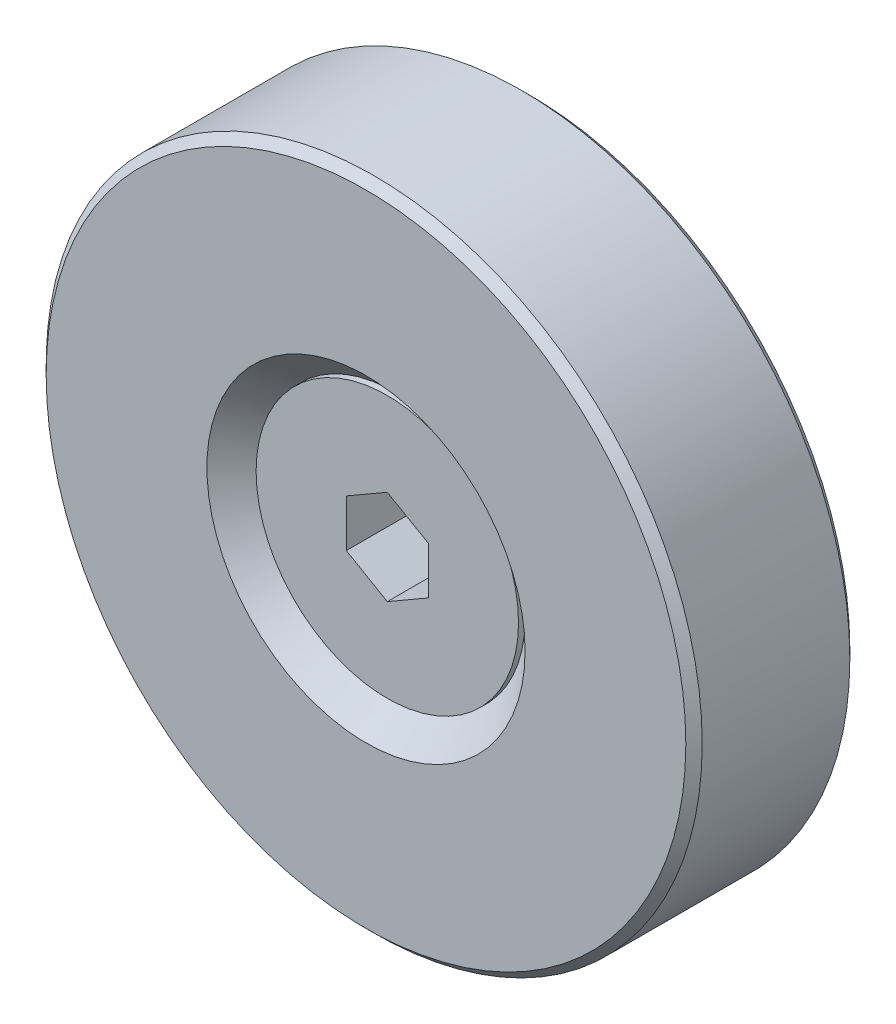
ISO-10303-21;
HEADER;
FILE_DESCRIPTION(('STEP AP214'),'2;1');
FILE_NAME('part.step','',(''),(''),'','','');
FILE_SCHEMA(('AUTOMOTIVE_DESIGN { 1 0 10303 214 1 1 1 1 }'));
ENDSEC;
DATA;
#1=APPLICATION_CONTEXT('core data for automotive mechanical design processes');
#2=APPLICATION_PROTOCOL_DEFINITION('international standard','automotive_design',2000,#1);
#3=PRODUCT_CONTEXT('',#1,'mechanical');
#4=PRODUCT('Part','Part','',(#3));
#5=PRODUCT_RELATED_PRODUCT_CATEGORY('part','',(#4));
#6=PRODUCT_DEFINITION_FORMATION('','',#4);
#7=PRODUCT_DEFINITION_CONTEXT('part definition',#1,'design');
#8=PRODUCT_DEFINITION('design','',#6,#7);
#9=PRODUCT_DEFINITION_SHAPE('','',#8);
#10=(LENGTH_UNIT() NAMED_UNIT(*) SI_UNIT(.MILLI.,.METRE.));
#11=(NAMED_UNIT(*) PLANE_ANGLE_UNIT() SI_UNIT($,.RADIAN.));
#12=(NAMED_UNIT(*) SI_UNIT($,.STERADIAN.) SOLID_ANGLE_UNIT());
#13=UNCERTAINTY_MEASURE_WITH_UNIT(LENGTH_MEASURE(1.E-05),#10,'distance_accuracy_value','');
#14=(GEOMETRIC_REPRESENTATION_CONTEXT(3) GLOBAL_UNCERTAINTY_ASSIGNED_CONTEXT((#13)) GLOBAL_UNIT_ASSIGNED_CONTEXT((#10,
#11,#12)) REPRESENTATION_CONTEXT('',''));
#15=CARTESIAN_POINT('',(0.,0.,0.));
#16=DIRECTION('',(0.,0.,1.));
#17=DIRECTION('',(1.,0.,0.));
#18=AXIS2_PLACEMENT_3D('',#15,#16,#17);
#19=CARTESIAN_POINT('',(0.,4.70000000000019,0.));
#20=DIRECTION('',(0.,0.,1.));
#21=DIRECTION('',(1.,0.,0.));
#22=AXIS2_PLACEMENT_3D('',#19,#20,#21);
#23=PLANE('',#22);
#24=CARTESIAN_POINT('',(0.,-1.87317522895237E-13,0.));
#25=DIRECTION('',(0.,0.,1.));
#26=DIRECTION('',(1.,0.,0.));
#27=AXIS2_PLACEMENT_3D('',#24,#25,#26);
#28=CIRCLE('',#27,4.70000000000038);
#29=CARTESIAN_POINT('',(4.70000000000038,-1.87317522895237E-13,0.));
#30=VERTEX_POINT('',#29);
#31=EDGE_CURVE('E140',#30,#30,#28,.T.);
#32=ORIENTED_EDGE('',*,*,#31,.T.);
#33=EDGE_LOOP('',(#32));
#34=FACE_BOUND('',#33,.T.);
#35=CARTESIAN_POINT('',(0.,0.,0.));
#36=DIRECTION('',(0.,0.,1.));
#37=DIRECTION('',(1.,0.,0.));
#38=AXIS2_PLACEMENT_3D('',#35,#36,#37);
#39=CIRCLE('',#38,19.5);
#40=CARTESIAN_POINT('',(19.5,0.,0.));
#41=VERTEX_POINT('',#40);
#42=EDGE_CURVE('E384',#41,#41,#39,.T.);
#43=ORIENTED_EDGE('',*,*,#42,.F.);
#44=EDGE_LOOP('',(#43));
#45=FACE_BOUND('',#44,.T.);
#46=ADVANCED_FACE('F14',(#34,#45),#23,.F.);
#47=CARTESIAN_POINT('',(0.,-1.87317522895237E-13,0.5));
#48=DIRECTION('',(0.,0.,-1.));
#49=DIRECTION('',(-1.,0.,0.));
#50=AXIS2_PLACEMENT_3D('',#47,#48,#49);
#51=CONICAL_SURFACE('',#50,4.20000000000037,0.785398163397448);
#52=ORIENTED_EDGE('',*,*,#31,.F.);
#53=EDGE_LOOP('',(#52));
#54=FACE_BOUND('',#53,.T.);
#55=CARTESIAN_POINT('',(0.,-1.87317522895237E-13,0.5));
#56=DIRECTION('',(0.,0.,1.));
#57=DIRECTION('',(1.,0.,0.));
#58=AXIS2_PLACEMENT_3D('',#55,#56,#57);
#59=CIRCLE('',#58,4.20000000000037);
#60=CARTESIAN_POINT('',(4.20000000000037,-1.87317522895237E-13,0.5));
#61=VERTEX_POINT('',#60);
#62=EDGE_CURVE('E137',#61,#61,#59,.T.);
#63=ORIENTED_EDGE('',*,*,#62,.T.);
#64=EDGE_LOOP('',(#63));
#65=FACE_BOUND('',#64,.T.);
#66=ADVANCED_FACE('F184',(#54,#65),#51,.F.);
#67=CARTESIAN_POINT('',(0.,-1.87317522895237E-13,15.0000000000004));
#68=DIRECTION('',(0.,0.,1.));
#69=DIRECTION('',(1.,0.,0.));
#70=AXIS2_PLACEMENT_3D('',#67,#68,#69);
#71=CYLINDRICAL_SURFACE('',#70,4.20000000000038);
#72=ORIENTED_EDGE('',*,*,#62,.F.);
#73=EDGE_LOOP('',(#72));
#74=FACE_BOUND('',#73,.T.);
#75=CARTESIAN_POINT('',(0.,-1.87317522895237E-13,4.5));
#76=DIRECTION('',(0.,0.,1.));
#77=DIRECTION('',(1.,0.,0.));
#78=AXIS2_PLACEMENT_3D('',#75,#76,#77);
#79=CIRCLE('',#78,4.20000000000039);
#80=CARTESIAN_POINT('',(4.20000000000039,-1.87317522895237E-13,4.5));
#81=VERTEX_POINT('',#80);
#82=EDGE_CURVE('E134',#81,#81,#79,.T.);
#83=ORIENTED_EDGE('',*,*,#82,.T.);
#84=EDGE_LOOP('',(#83));
#85=FACE_BOUND('',#84,.T.);
#86=ADVANCED_FACE('F190',(#74,#85),#71,.F.);
#87=CARTESIAN_POINT('',(0.,-1.87317522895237E-13,4.29999999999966));
#88=DIRECTION('',(0.,0.,1.));
#89=DIRECTION('',(1.,0.,0.));
#90=AXIS2_PLACEMENT_3D('',#87,#88,#89);
#91=CONICAL_SURFACE('',#90,4.00000000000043,0.785398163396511);
#92=ORIENTED_EDGE('',*,*,#82,.F.);
#93=EDGE_LOOP('',(#92));
#94=FACE_BOUND('',#93,.T.);
#95=CARTESIAN_POINT('',(0.,-1.87317522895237E-13,4.29999999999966));
#96=DIRECTION('',(0.,0.,1.));
#97=DIRECTION('',(1.,0.,0.));
#98=AXIS2_PLACEMENT_3D('',#95,#96,#97);
#99=CIRCLE('',#98,4.00000000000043);
#100=CARTESIAN_POINT('',(4.00000000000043,-1.87317522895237E-13,4.29999999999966));
#101=VERTEX_POINT('',#100);
#102=EDGE_CURVE('E131',#101,#101,#99,.T.);
#103=ORIENTED_EDGE('',*,*,#102,.T.);
#104=EDGE_LOOP('',(#103));
#105=FACE_BOUND('',#104,.T.);
#106=ADVANCED_FACE('F225',(#94,#105),#91,.T.);
#107=CARTESIAN_POINT('',(0.,-1.87317522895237E-13,15.0000000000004));
#108=DIRECTION('',(0.,0.,1.));
#109=DIRECTION('',(1.,0.,0.));
#110=AXIS2_PLACEMENT_3D('',#107,#108,#109);
#111=CYLINDRICAL_SURFACE('',#110,4.00000000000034);
#112=ORIENTED_EDGE('',*,*,#102,.F.);
#113=EDGE_LOOP('',(#112));
#114=FACE_BOUND('',#113,.T.);
#115=CARTESIAN_POINT('',(0.,-1.87317522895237E-13,-10.1));
#116=DIRECTION('',(0.,0.,1.));
#117=DIRECTION('',(1.,0.,0.));
#118=AXIS2_PLACEMENT_3D('',#115,#116,#117);
#119=CIRCLE('',#118,4.00000000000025);
#120=CARTESIAN_POINT('',(4.00000000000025,-1.87317522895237E-13,-10.1));
#121=VERTEX_POINT('',#120);
#122=EDGE_CURVE('E128',#121,#121,#119,.T.);
#123=ORIENTED_EDGE('',*,*,#122,.T.);
#124=EDGE_LOOP('',(#123));
#125=FACE_BOUND('',#124,.T.);
#126=ADVANCED_FACE('F221',(#114,#125),#111,.T.);
#127=CARTESIAN_POINT('',(0.,-1.87317522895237E-13,-11.3));
#128=DIRECTION('',(0.,0.,1.));
#129=DIRECTION('',(1.,0.,0.));
#130=AXIS2_PLACEMENT_3D('',#127,#128,#129);
#131=CONICAL_SURFACE('',#130,2.80000000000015,0.785398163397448);
#132=ORIENTED_EDGE('',*,*,#122,.F.);
#133=EDGE_LOOP('',(#132));
#134=FACE_BOUND('',#133,.T.);
#135=CARTESIAN_POINT('',(0.,-1.87317522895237E-13,-11.3));
#136=DIRECTION('',(0.,0.,1.));
#137=DIRECTION('',(1.,0.,0.));
#138=AXIS2_PLACEMENT_3D('',#135,#136,#137);
#139=CIRCLE('',#138,2.80000000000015);
#140=CARTESIAN_POINT('',(2.80000000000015,-1.87317522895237E-13,-11.3));
#141=VERTEX_POINT('',#140);
#142=EDGE_CURVE('E125',#141,#141,#139,.T.);
#143=ORIENTED_EDGE('',*,*,#142,.T.);
#144=EDGE_LOOP('',(#143));
#145=FACE_BOUND('',#144,.T.);
#146=ADVANCED_FACE('F217',(#134,#145),#131,.T.);
#147=CARTESIAN_POINT('',(0.,2.79999999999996,-11.3000000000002));
#148=DIRECTION('',(0.,0.,1.));
#149=DIRECTION('',(1.,0.,0.));
#150=AXIS2_PLACEMENT_3D('',#147,#148,#149);
#151=PLANE('',#150);
#152=ORIENTED_EDGE('',*,*,#142,.F.);
#153=EDGE_LOOP('',(#152));
#154=FACE_BOUND('',#153,.T.);
#155=ADVANCED_FACE('F213',(#154),#151,.F.);
#156=CARTESIAN_POINT('',(0.,0.,9.5));
#157=DIRECTION('',(0.,0.,-1.));
#158=DIRECTION('',(-1.,0.,0.));
#159=AXIS2_PLACEMENT_3D('',#156,#157,#158);
#160=CONICAL_SURFACE('',#159,20.,0.785398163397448);
#161=CARTESIAN_POINT('',(0.,0.,10.));
#162=DIRECTION('',(0.,0.,1.));
#163=DIRECTION('',(1.,0.,0.));
#164=AXIS2_PLACEMENT_3D('',#161,#162,#163);
#165=CIRCLE('',#164,19.5);
#166=CARTESIAN_POINT('',(19.5,0.,10.));
#167=VERTEX_POINT('',#166);
#168=EDGE_CURVE('E104',#167,#167,#165,.T.);
#169=ORIENTED_EDGE('',*,*,#168,.F.);
#170=EDGE_LOOP('',(#169));
#171=FACE_BOUND('',#170,.T.);
#172=CARTESIAN_POINT('',(0.,0.,9.5));
#173=DIRECTION('',(0.,0.,1.));
#174=DIRECTION('',(1.,0.,0.));
#175=AXIS2_PLACEMENT_3D('',#172,#173,#174);
#176=CIRCLE('',#175,20.);
#177=CARTESIAN_POINT('',(20.,0.,9.5));
#178=VERTEX_POINT('',#177);
#179=EDGE_CURVE('E154',#178,#178,#176,.T.);
#180=ORIENTED_EDGE('',*,*,#179,.T.);
#181=EDGE_LOOP('',(#180));
#182=FACE_BOUND('',#181,.T.);
#183=ADVANCED_FACE('F216',(#171,#182),#160,.T.);
#184=CARTESIAN_POINT('',(0.,0.,17.9912783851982));
#185=DIRECTION('',(0.,0.,1.));
#186=DIRECTION('',(1.,0.,0.));
#187=AXIS2_PLACEMENT_3D('',#184,#185,#186);
#188=CYLINDRICAL_SURFACE('',#187,20.);
#189=ORIENTED_EDGE('',*,*,#179,.F.);
#190=EDGE_LOOP('',(#189));
#191=FACE_BOUND('',#190,.T.);
#192=CARTESIAN_POINT('',(0.,0.,0.5));
#193=DIRECTION('',(0.,0.,1.));
#194=DIRECTION('',(1.,0.,0.));
#195=AXIS2_PLACEMENT_3D('',#192,#193,#194);
#196=CIRCLE('',#195,20.);
#197=CARTESIAN_POINT('',(20.,0.,0.5));
#198=VERTEX_POINT('',#197);
#199=EDGE_CURVE('E157',#198,#198,#196,.T.);
#200=ORIENTED_EDGE('',*,*,#199,.T.);
#201=EDGE_LOOP('',(#200));
#202=FACE_BOUND('',#201,.T.);
#203=ADVANCED_FACE('F274',(#191,#202),#188,.T.);
#204=CARTESIAN_POINT('',(0.,0.,0.));
#205=DIRECTION('',(0.,0.,1.));
#206=DIRECTION('',(1.,0.,0.));
#207=AXIS2_PLACEMENT_3D('',#204,#205,#206);
#208=CONICAL_SURFACE('',#207,19.5,0.785398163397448);
#209=ORIENTED_EDGE('',*,*,#199,.F.);
#210=EDGE_LOOP('',(#209));
#211=FACE_BOUND('',#210,.T.);
#212=ORIENTED_EDGE('',*,*,#42,.T.);
#213=EDGE_LOOP('',(#212));
#214=FACE_BOUND('',#213,.T.);
#215=ADVANCED_FACE('F282',(#211,#214),#208,.T.);
#216=CARTESIAN_POINT('',(0.,2.88675134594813,4.7));
#217=DIRECTION('',(0.,0.,1.));
#218=DIRECTION('',(1.,0.,0.));
#219=AXIS2_PLACEMENT_3D('',#216,#217,#218);
#220=PLANE('',#219);
#221=DIRECTION('',(-0.866025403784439,0.5,0.));
#222=VECTOR('',#221,1.);
#223=CARTESIAN_POINT('',(2.5,1.44337567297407,4.7));
#224=LINE('',#223,#222);
#225=CARTESIAN_POINT('',(2.5,1.44337567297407,4.7));
#226=VERTEX_POINT('',#225);
#227=CARTESIAN_POINT('',(0.,2.88675134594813,4.7));
#228=VERTEX_POINT('',#227);
#229=EDGE_CURVE('E115',#226,#228,#224,.T.);
#230=ORIENTED_EDGE('',*,*,#229,.T.);
#231=DIRECTION('',(-0.866025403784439,-0.5,0.));
#232=VECTOR('',#231,1.);
#233=CARTESIAN_POINT('',(0.,2.88675134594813,4.7));
#234=LINE('',#233,#232);
#235=CARTESIAN_POINT('',(-2.5,1.44337567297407,4.7));
#236=VERTEX_POINT('',#235);
#237=EDGE_CURVE('E97',#228,#236,#234,.T.);
#238=ORIENTED_EDGE('',*,*,#237,.T.);
#239=DIRECTION('',(0.,-1.,0.));
#240=VECTOR('',#239,1.);
#241=CARTESIAN_POINT('',(-2.5,1.44337567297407,4.7));
#242=LINE('',#241,#240);
#243=CARTESIAN_POINT('',(-2.5,-1.44337567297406,4.7));
#244=VERTEX_POINT('',#243);
#245=EDGE_CURVE('E95',#236,#244,#242,.T.);
#246=ORIENTED_EDGE('',*,*,#245,.T.);
#247=DIRECTION('',(0.866025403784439,-0.5,0.));
#248=VECTOR('',#247,1.);
#249=CARTESIAN_POINT('',(-2.5,-1.44337567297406,4.7));
#250=LINE('',#249,#248);
#251=CARTESIAN_POINT('',(0.,-2.88675134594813,4.7));
#252=VERTEX_POINT('',#251);
#253=EDGE_CURVE('E74',#244,#252,#250,.T.);
#254=ORIENTED_EDGE('',*,*,#253,.T.);
#255=DIRECTION('',(0.866025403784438,0.5,0.));
#256=VECTOR('',#255,1.);
#257=CARTESIAN_POINT('',(0.,-2.88675134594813,4.7));
#258=LINE('',#257,#256);
#259=CARTESIAN_POINT('',(2.5,-1.44337567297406,4.7));
#260=VERTEX_POINT('',#259);
#261=EDGE_CURVE('E85',#252,#260,#258,.T.);
#262=ORIENTED_EDGE('',*,*,#261,.T.);
#263=DIRECTION('',(0.,1.,0.));
#264=VECTOR('',#263,1.);
#265=CARTESIAN_POINT('',(2.5,-1.44337567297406,4.7));
#266=LINE('',#265,#264);
#267=EDGE_CURVE('E89',#260,#226,#266,.T.);
#268=ORIENTED_EDGE('',*,*,#267,.T.);
#269=EDGE_LOOP('',(#230,#238,#246,#254,#262,#268));
#270=FACE_BOUND('',#269,.T.);
#271=ADVANCED_FACE('F92',(#270),#220,.T.);
#272=CARTESIAN_POINT('',(-2.5,1.44337567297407,4.7));
#273=DIRECTION('',(-1.,0.,0.));
#274=DIRECTION('',(0.,-1.,0.));
#275=AXIS2_PLACEMENT_3D('',#272,#273,#274);
#276=PLANE('',#275);
#277=DIRECTION('',(0.,-1.,0.));
#278=VECTOR('',#277,1.);
#279=CARTESIAN_POINT('',(-2.5,1.44337567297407,8.7));
#280=LINE('',#279,#278);
#281=CARTESIAN_POINT('',(-2.5,1.44337567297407,8.7));
#282=VERTEX_POINT('',#281);
#283=CARTESIAN_POINT('',(-2.5,-1.44337567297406,8.7));
#284=VERTEX_POINT('',#283);
#285=EDGE_CURVE('E107',#282,#284,#280,.T.);
#286=ORIENTED_EDGE('',*,*,#285,.T.);
#287=DIRECTION('',(0.,0.,1.));
#288=VECTOR('',#287,1.);
#289=CARTESIAN_POINT('',(-2.5,-1.44337567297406,4.7));
#290=LINE('',#289,#288);
#291=EDGE_CURVE('E82',#244,#284,#290,.T.);
#292=ORIENTED_EDGE('',*,*,#291,.F.);
#293=ORIENTED_EDGE('',*,*,#245,.F.);
#294=DIRECTION('',(0.,0.,1.));
#295=VECTOR('',#294,1.);
#296=CARTESIAN_POINT('',(-2.5,1.44337567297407,4.7));
#297=LINE('',#296,#295);
#298=EDGE_CURVE('E120',#236,#282,#297,.T.);
#299=ORIENTED_EDGE('',*,*,#298,.T.);
#300=EDGE_LOOP('',(#286,#292,#293,#299));
#301=FACE_BOUND('',#300,.T.);
#302=ADVANCED_FACE('F166',(#301),#276,.F.);
#303=CARTESIAN_POINT('',(-2.5,-1.44337567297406,4.7));
#304=DIRECTION('',(-0.5,-0.866025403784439,0.));
#305=DIRECTION('',(0.866025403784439,-0.5,0.));
#306=AXIS2_PLACEMENT_3D('',#303,#304,#305);
#307=PLANE('',#306);
#308=DIRECTION('',(0.866025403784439,-0.5,0.));
#309=VECTOR('',#308,1.);
#310=CARTESIAN_POINT('',(-2.5,-1.44337567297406,8.7));
#311=LINE('',#310,#309);
#312=CARTESIAN_POINT('',(0.,-2.88675134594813,8.7));
#313=VERTEX_POINT('',#312);
#314=EDGE_CURVE('E77',#284,#313,#311,.T.);
#315=ORIENTED_EDGE('',*,*,#314,.T.);
#316=DIRECTION('',(0.,0.,1.));
#317=VECTOR('',#316,1.);
#318=CARTESIAN_POINT('',(0.,-2.88675134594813,4.7));
#319=LINE('',#318,#317);
#320=EDGE_CURVE('E70',#252,#313,#319,.T.);
#321=ORIENTED_EDGE('',*,*,#320,.F.);
#322=ORIENTED_EDGE('',*,*,#253,.F.);
#323=ORIENTED_EDGE('',*,*,#291,.T.);
#324=EDGE_LOOP('',(#315,#321,#322,#323));
#325=FACE_BOUND('',#324,.T.);
#326=ADVANCED_FACE('F72',(#325),#307,.F.);
#327=CARTESIAN_POINT('',(0.,-2.88675134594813,4.7));
#328=DIRECTION('',(0.5,-0.866025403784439,0.));
#329=DIRECTION('',(0.866025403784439,0.5,0.));
#330=AXIS2_PLACEMENT_3D('',#327,#328,#329);
#331=PLANE('',#330);
#332=DIRECTION('',(0.866025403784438,0.5,0.));
#333=VECTOR('',#332,1.);
#334=CARTESIAN_POINT('',(0.,-2.88675134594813,8.7));
#335=LINE('',#334,#333);
#336=CARTESIAN_POINT('',(2.5,-1.44337567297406,8.7));
#337=VERTEX_POINT('',#336);
#338=EDGE_CURVE('E111',#313,#337,#335,.T.);
#339=ORIENTED_EDGE('',*,*,#338,.T.);
#340=DIRECTION('',(0.,0.,1.));
#341=VECTOR('',#340,1.);
#342=CARTESIAN_POINT('',(2.5,-1.44337567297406,4.7));
#343=LINE('',#342,#341);
#344=EDGE_CURVE('E81',#260,#337,#343,.T.);
#345=ORIENTED_EDGE('',*,*,#344,.F.);
#346=ORIENTED_EDGE('',*,*,#261,.F.);
#347=ORIENTED_EDGE('',*,*,#320,.T.);
#348=EDGE_LOOP('',(#339,#345,#346,#347));
#349=FACE_BOUND('',#348,.T.);
#350=ADVANCED_FACE('F86',(#349),#331,.F.);
#351=CARTESIAN_POINT('',(2.5,-1.44337567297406,4.7));
#352=DIRECTION('',(1.,0.,0.));
#353=DIRECTION('',(0.,0.,-1.));
#354=AXIS2_PLACEMENT_3D('',#351,#352,#353);
#355=PLANE('',#354);
#356=DIRECTION('',(0.,1.,0.));
#357=VECTOR('',#356,1.);
#358=CARTESIAN_POINT('',(2.5,-1.44337567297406,8.7));
#359=LINE('',#358,#357);
#360=CARTESIAN_POINT('',(2.5,1.44337567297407,8.7));
#361=VERTEX_POINT('',#360);
#362=EDGE_CURVE('E113',#337,#361,#359,.T.);
#363=ORIENTED_EDGE('',*,*,#362,.T.);
#364=DIRECTION('',(0.,0.,1.));
#365=VECTOR('',#364,1.);
#366=CARTESIAN_POINT('',(2.5,1.44337567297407,4.7));
#367=LINE('',#366,#365);
#368=EDGE_CURVE('E37',#226,#361,#367,.T.);
#369=ORIENTED_EDGE('',*,*,#368,.F.);
#370=ORIENTED_EDGE('',*,*,#267,.F.);
#371=ORIENTED_EDGE('',*,*,#344,.T.);
#372=EDGE_LOOP('',(#363,#369,#370,#371));
#373=FACE_BOUND('',#372,.T.);
#374=ADVANCED_FACE('F171',(#373),#355,.F.);
#375=CARTESIAN_POINT('',(2.5,1.44337567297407,4.7));
#376=DIRECTION('',(0.5,0.866025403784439,0.));
#377=DIRECTION('',(-0.866025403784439,0.5,0.));
#378=AXIS2_PLACEMENT_3D('',#375,#376,#377);
#379=PLANE('',#378);
#380=DIRECTION('',(-0.866025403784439,0.5,0.));
#381=VECTOR('',#380,1.);
#382=CARTESIAN_POINT('',(2.5,1.44337567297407,8.7));
#383=LINE('',#382,#381);
#384=CARTESIAN_POINT('',(0.,2.88675134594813,8.7));
#385=VERTEX_POINT('',#384);
#386=EDGE_CURVE('E29',#361,#385,#383,.T.);
#387=ORIENTED_EDGE('',*,*,#386,.T.);
#388=DIRECTION('',(0.,0.,1.));
#389=VECTOR('',#388,1.);
#390=CARTESIAN_POINT('',(0.,2.88675134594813,4.7));
#391=LINE('',#390,#389);
#392=EDGE_CURVE('E59',#228,#385,#391,.T.);
#393=ORIENTED_EDGE('',*,*,#392,.F.);
#394=ORIENTED_EDGE('',*,*,#229,.F.);
#395=ORIENTED_EDGE('',*,*,#368,.T.);
#396=EDGE_LOOP('',(#387,#393,#394,#395));
#397=FACE_BOUND('',#396,.T.);
#398=ADVANCED_FACE('F173',(#397),#379,.F.);
#399=CARTESIAN_POINT('',(0.,2.88675134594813,4.7));
#400=DIRECTION('',(-0.5,0.866025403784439,0.));
#401=DIRECTION('',(-0.866025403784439,-0.5,0.));
#402=AXIS2_PLACEMENT_3D('',#399,#400,#401);
#403=PLANE('',#402);
#404=DIRECTION('',(-0.866025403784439,-0.5,0.));
#405=VECTOR('',#404,1.);
#406=CARTESIAN_POINT('',(0.,2.88675134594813,8.7));
#407=LINE('',#406,#405);
#408=EDGE_CURVE('E103',#385,#282,#407,.T.);
#409=ORIENTED_EDGE('',*,*,#408,.T.);
#410=ORIENTED_EDGE('',*,*,#298,.F.);
#411=ORIENTED_EDGE('',*,*,#237,.F.);
#412=ORIENTED_EDGE('',*,*,#392,.T.);
#413=EDGE_LOOP('',(#409,#410,#411,#412));
#414=FACE_BOUND('',#413,.T.);
#415=ADVANCED_FACE('F162',(#414),#403,.F.);
#416=CARTESIAN_POINT('',(0.,-1.87317522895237E-13,8.7));
#417=DIRECTION('',(0.,0.,-1.));
#418=DIRECTION('',(-1.,0.,0.));
#419=AXIS2_PLACEMENT_3D('',#416,#417,#418);
#420=PLANE('',#419);
#421=ORIENTED_EDGE('',*,*,#408,.F.);
#422=ORIENTED_EDGE('',*,*,#386,.F.);
#423=ORIENTED_EDGE('',*,*,#362,.F.);
#424=ORIENTED_EDGE('',*,*,#338,.F.);
#425=ORIENTED_EDGE('',*,*,#314,.F.);
#426=ORIENTED_EDGE('',*,*,#285,.F.);
#427=EDGE_LOOP('',(#421,#422,#423,#424,#425,#426));
#428=FACE_BOUND('',#427,.T.);
#429=CARTESIAN_POINT('',(0.,-1.87317522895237E-13,8.7));
#430=DIRECTION('',(0.,0.,1.));
#431=DIRECTION('',(1.,0.,0.));
#432=AXIS2_PLACEMENT_3D('',#429,#430,#431);
#433=CIRCLE('',#432,8.00000000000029);
#434=CARTESIAN_POINT('',(8.00000000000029,-1.87317522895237E-13,8.7));
#435=VERTEX_POINT('',#434);
#436=EDGE_CURVE('E117',#435,#435,#433,.T.);
#437=ORIENTED_EDGE('',*,*,#436,.T.);
#438=EDGE_LOOP('',(#437));
#439=FACE_BOUND('',#438,.T.);
#440=ADVANCED_FACE('F168',(#428,#439),#420,.F.);
#441=CARTESIAN_POINT('',(0.,-1.87317522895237E-13,15.0000000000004));
#442=DIRECTION('',(0.,0.,1.));
#443=DIRECTION('',(1.,0.,0.));
#444=AXIS2_PLACEMENT_3D('',#441,#442,#443);
#445=CYLINDRICAL_SURFACE('',#444,8.00000000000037);
#446=ORIENTED_EDGE('',*,*,#436,.F.);
#447=EDGE_LOOP('',(#446));
#448=FACE_BOUND('',#447,.T.);
#449=CARTESIAN_POINT('',(0.,-1.87317522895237E-13,8.29999999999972));
#450=DIRECTION('',(0.,0.,1.));
#451=DIRECTION('',(1.,0.,0.));
#452=AXIS2_PLACEMENT_3D('',#449,#450,#451);
#453=CIRCLE('',#452,8.00000000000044);
#454=CARTESIAN_POINT('',(8.00000000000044,-1.87317522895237E-13,8.29999999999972));
#455=VERTEX_POINT('',#454);
#456=EDGE_CURVE('E9',#455,#455,#453,.T.);
#457=ORIENTED_EDGE('',*,*,#456,.T.);
#458=EDGE_LOOP('',(#457));
#459=FACE_BOUND('',#458,.T.);
#460=ADVANCED_FACE('F16',(#448,#459),#445,.T.);
#461=CARTESIAN_POINT('',(0.,-1.87317522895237E-13,10.));
#462=DIRECTION('',(0.,0.,1.));
#463=DIRECTION('',(1.,0.,0.));
#464=AXIS2_PLACEMENT_3D('',#461,#462,#463);
#465=CONICAL_SURFACE('',#464,9.70000000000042,0.785398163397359);
#466=ORIENTED_EDGE('',*,*,#456,.F.);
#467=EDGE_LOOP('',(#466));
#468=FACE_BOUND('',#467,.T.);
#469=CARTESIAN_POINT('',(0.,-1.87317522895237E-13,10.));
#470=DIRECTION('',(0.,0.,1.));
#471=DIRECTION('',(1.,0.,0.));
#472=AXIS2_PLACEMENT_3D('',#469,#470,#471);
#473=CIRCLE('',#472,9.70000000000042);
#474=CARTESIAN_POINT('',(9.70000000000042,-1.87317522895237E-13,10.));
#475=VERTEX_POINT('',#474);
#476=EDGE_CURVE('E22',#475,#475,#473,.T.);
#477=ORIENTED_EDGE('',*,*,#476,.T.);
#478=EDGE_LOOP('',(#477));
#479=FACE_BOUND('',#478,.T.);
#480=ADVANCED_FACE('F145',(#468,#479),#465,.F.);
#481=CARTESIAN_POINT('',(0.,14.5000000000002,10.));
#482=DIRECTION('',(0.,0.,-1.));
#483=DIRECTION('',(-1.,0.,0.));
#484=AXIS2_PLACEMENT_3D('',#481,#482,#483);
#485=PLANE('',#484);
#486=ORIENTED_EDGE('',*,*,#476,.F.);
#487=EDGE_LOOP('',(#486));
#488=FACE_BOUND('',#487,.T.);
#489=ORIENTED_EDGE('',*,*,#168,.T.);
#490=EDGE_LOOP('',(#489));
#491=FACE_BOUND('',#490,.T.);
#492=ADVANCED_FACE('F147',(#488,#491),#485,.F.);
#493=CLOSED_SHELL('',(#46,#66,#86,#106,#126,#146,#155,#183,#203,#215,#271,#302,#326,#350,#374,
#398,#415,#440,#460,#480,#492));
#494=MANIFOLD_SOLID_BREP('B1',#493);
#495=ADVANCED_BREP_SHAPE_REPRESENTATION('',(#18,#494),#14);
#496=SHAPE_DEFINITION_REPRESENTATION(#9,#495);
ENDSEC;
END-ISO-10303-21;
